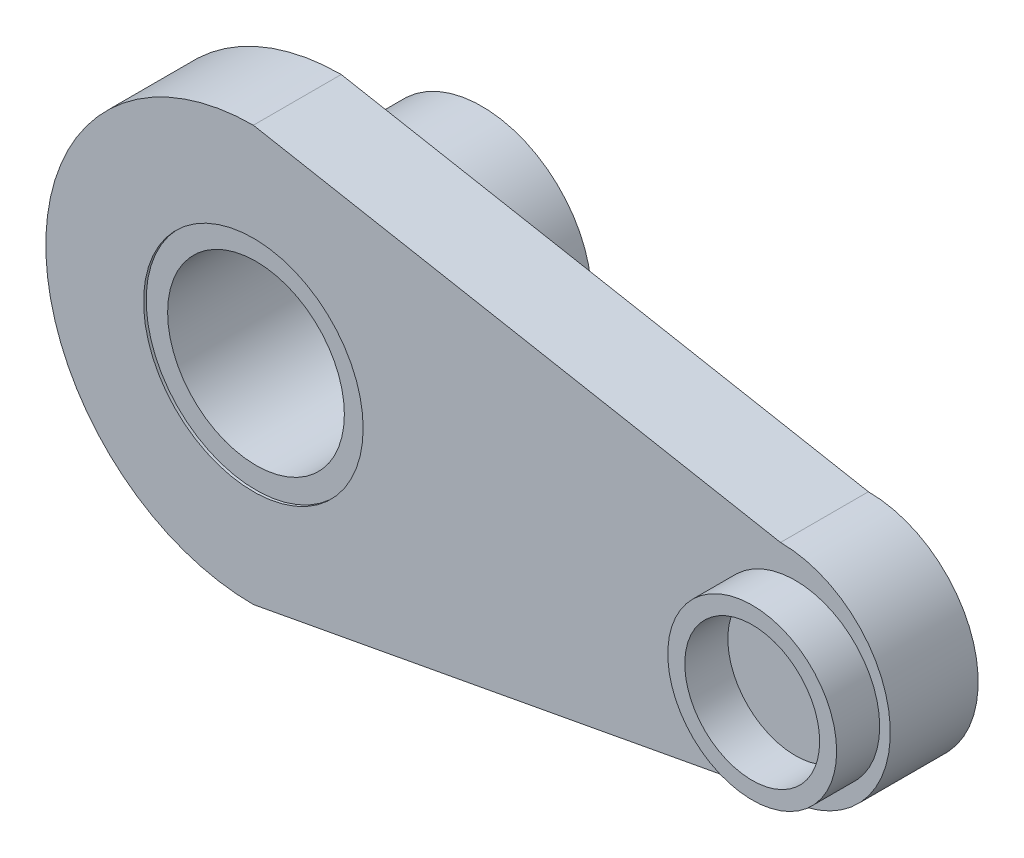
from build123d import *

# Parameters (mm, degrees)
SKETCH1_R      = 7.935
EXTRUDE1_DEPTH = 6.35
SKETCH2_R      = 6.10143424
SKETCH2_R_2    = 4.873232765
EXTRUDE2_DEPTH = 3.11143402
EXTRUDE3_START = 10.16
SKETCH3_R      = 7.935
SKETCH3_R_2    = 6.387001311
EXTRUDE3_DEPTH = 10.16
SKETCH4_R      = 7.935
SKETCH4_R_2    = 6.387001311
EXTRUDE5_DEPTH = 6.16


with BuildPart() as part:
    # Sketch1 → Extrude1 (new body)
    with BuildSketch(Plane.XY):
        with BuildLine():
            ThreePointArc((0, 15), (-15, 0), (0, -15))
            Line((0, -15), (38.1, -7.935))
            ThreePointArc((38.1, -7.935), (46.035, 0), (38.1, 7.935))
            Line((38.1, 7.935), (0, 15))
        make_face()
        Circle(SKETCH1_R, mode=Mode.SUBTRACT)
    extrude(amount=EXTRUDE1_DEPTH)

    # Sketch2 → Extrude2 (add)
    with BuildSketch(Plane.XY.offset(6.35)):
        with Locations((39.164876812, 0)):
            Circle(SKETCH2_R)
        with Locations((39.164876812, 0)):
            Circle(SKETCH2_R_2, mode=Mode.SUBTRACT)
    extrude(amount=EXTRUDE2_DEPTH)



with BuildPart() as body_2:
    # Sketch3 → Extrude3 (new body)
    with BuildSketch(Plane(origin=(0, 0, 0), x_dir=(-1, 0, 0), z_dir=(0, 0, -1)).offset(EXTRUDE3_START)):
        with Locations(Location((0, 0, 0), (0, 0, 180))):
            Circle(SKETCH3_R)
        Circle(SKETCH3_R_2, mode=Mode.SUBTRACT)
    extrude(amount=-EXTRUDE3_DEPTH)


with BuildPart() as part_1:
    add(part.part)

    add(body_2.part)  # Extrude5 merges body 2
    # Sketch4 → Extrude5 (add)
    with BuildSketch(Plane.XY):
        Circle(SKETCH4_R)
        with Locations(Location((0, 0, 0), (0, 0, 180))):
            Circle(SKETCH4_R_2, mode=Mode.SUBTRACT)
    extrude(amount=EXTRUDE5_DEPTH)


solid = part_1.part
